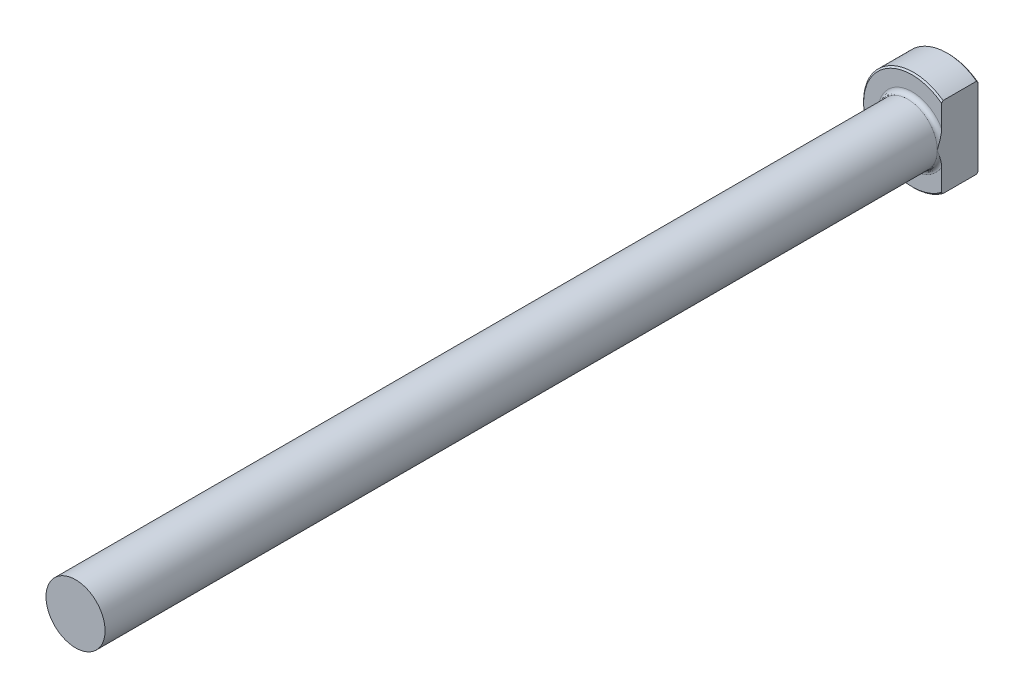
ISO-10303-21;
HEADER;
FILE_DESCRIPTION(('STEP AP214'),'2;1');
FILE_NAME('part.step','',(''),(''),'','','');
FILE_SCHEMA(('AUTOMOTIVE_DESIGN { 1 0 10303 214 1 1 1 1 }'));
ENDSEC;
DATA;
#1=APPLICATION_CONTEXT('core data for automotive mechanical design processes');
#2=APPLICATION_PROTOCOL_DEFINITION('international standard','automotive_design',2000,#1);
#3=PRODUCT_CONTEXT('',#1,'mechanical');
#4=PRODUCT('Part','Part','',(#3));
#5=PRODUCT_RELATED_PRODUCT_CATEGORY('part','',(#4));
#6=PRODUCT_DEFINITION_FORMATION('','',#4);
#7=PRODUCT_DEFINITION_CONTEXT('part definition',#1,'design');
#8=PRODUCT_DEFINITION('design','',#6,#7);
#9=PRODUCT_DEFINITION_SHAPE('','',#8);
#10=(LENGTH_UNIT() NAMED_UNIT(*) SI_UNIT(.MILLI.,.METRE.));
#11=(NAMED_UNIT(*) PLANE_ANGLE_UNIT() SI_UNIT($,.RADIAN.));
#12=(NAMED_UNIT(*) SI_UNIT($,.STERADIAN.) SOLID_ANGLE_UNIT());
#13=UNCERTAINTY_MEASURE_WITH_UNIT(LENGTH_MEASURE(1.E-05),#10,'distance_accuracy_value','');
#14=(GEOMETRIC_REPRESENTATION_CONTEXT(3) GLOBAL_UNCERTAINTY_ASSIGNED_CONTEXT((#13)) GLOBAL_UNIT_ASSIGNED_CONTEXT((#10,
#11,#12)) REPRESENTATION_CONTEXT('',''));
#15=CARTESIAN_POINT('',(0.,0.,0.));
#16=DIRECTION('',(0.,0.,1.));
#17=DIRECTION('',(1.,0.,0.));
#18=AXIS2_PLACEMENT_3D('',#15,#16,#17);
#19=CARTESIAN_POINT('',(0.,5.15873999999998,152.4));
#20=DIRECTION('',(0.,0.,1.));
#21=DIRECTION('',(1.,0.,0.));
#22=AXIS2_PLACEMENT_3D('',#19,#20,#21);
#23=PLANE('',#22);
#24=CARTESIAN_POINT('',(0.,0.,152.4));
#25=DIRECTION('',(0.,0.,-1.));
#26=DIRECTION('',(-1.,0.,0.));
#27=AXIS2_PLACEMENT_3D('',#24,#25,#26);
#28=CIRCLE('',#27,5.15873999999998);
#29=CARTESIAN_POINT('',(-5.15873999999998,0.,152.4));
#30=VERTEX_POINT('',#29);
#31=EDGE_CURVE('E96',#30,#30,#28,.T.);
#32=ORIENTED_EDGE('',*,*,#31,.F.);
#33=EDGE_LOOP('',(#32));
#34=FACE_BOUND('',#33,.T.);
#35=ADVANCED_FACE('F32',(#34),#23,.T.);
#36=CARTESIAN_POINT('',(0.,0.,-25.4347445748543));
#37=DIRECTION('',(0.,0.,-1.));
#38=DIRECTION('',(-1.,0.,0.));
#39=AXIS2_PLACEMENT_3D('',#36,#37,#38);
#40=CYLINDRICAL_SURFACE('',#39,5.15873999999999);
#41=ORIENTED_EDGE('',*,*,#31,.T.);
#42=EDGE_LOOP('',(#41));
#43=FACE_BOUND('',#42,.T.);
#44=CARTESIAN_POINT('',(0.,0.,7.112));
#45=DIRECTION('',(0.,0.,-1.));
#46=DIRECTION('',(-1.,0.,0.));
#47=AXIS2_PLACEMENT_3D('',#44,#45,#46);
#48=CIRCLE('',#47,5.15873999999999);
#49=CARTESIAN_POINT('',(5.15873999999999,0.,7.112));
#50=VERTEX_POINT('',#49);
#51=EDGE_CURVE('E101',#50,#50,#48,.T.);
#52=ORIENTED_EDGE('',*,*,#51,.F.);
#53=EDGE_LOOP('',(#52));
#54=FACE_BOUND('',#53,.T.);
#55=ADVANCED_FACE('F158',(#43,#54),#40,.T.);
#56=CARTESIAN_POINT('',(0.,0.,7.112));
#57=DIRECTION('',(0.,0.,-1.));
#58=DIRECTION('',(-1.,0.,0.));
#59=AXIS2_PLACEMENT_3D('',#56,#57,#58);
#60=TOROIDAL_SURFACE('',#59,5.92074,0.762);
#61=CARTESIAN_POINT('',(5.15873999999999,0.,7.112));
#62=CARTESIAN_POINT('',(5.15873999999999,-5.71096526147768E-11,7.11200099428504));
#63=CARTESIAN_POINT('',(5.15873999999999,-2.22462273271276E-07,7.11200198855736));
#64=CARTESIAN_POINT('',(5.15873999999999,-9.18675676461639E-07,7.11200389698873));
#65=CARTESIAN_POINT('',(5.15873999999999,-1.40015166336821E-06,7.11200480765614));
#66=CARTESIAN_POINT('',(5.15873999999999,-2.5548942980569E-06,7.11200662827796));
#67=CARTESIAN_POINT('',(5.15873999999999,-3.24258702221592E-06,7.11200752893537));
#68=CARTESIAN_POINT('',(5.15873999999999,-4.72017169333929E-06,7.11200922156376));
#69=CARTESIAN_POINT('',(5.15873999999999,-5.50898685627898E-06,7.11201001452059));
#70=CARTESIAN_POINT('',(5.15873999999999,-8.35669321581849E-06,7.11201269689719));
#71=CARTESIAN_POINT('',(5.15873999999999,-1.05473927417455E-05,7.11201444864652));
#72=CARTESIAN_POINT('',(5.15873999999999,-1.50564248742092E-05,7.11201754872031));
#73=CARTESIAN_POINT('',(5.15873999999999,-1.73660536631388E-05,7.11201891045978));
#74=CARTESIAN_POINT('',(5.15873999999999,-2.64531968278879E-05,7.11202408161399));
#75=CARTESIAN_POINT('',(5.15873999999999,-3.33874300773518E-05,7.11202762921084));
#76=CARTESIAN_POINT('',(5.15873999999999,-4.70045811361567E-05,7.11203337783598));
#77=CARTESIAN_POINT('',(5.15873999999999,-5.36479360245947E-05,7.11203567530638));
#78=CARTESIAN_POINT('',(5.15873999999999,-8.21517361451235E-05,7.11204552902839));
#79=CARTESIAN_POINT('',(5.15873999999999,-0.000104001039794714,7.11205307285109));
#80=CARTESIAN_POINT('',(5.15873999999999,-0.000144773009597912,7.11206508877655));
#81=CARTESIAN_POINT('',(5.15873999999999,-0.000163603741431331,7.11206985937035));
#82=CARTESIAN_POINT('',(5.15873999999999,-0.000301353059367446,7.11210789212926));
#83=CARTESIAN_POINT('',(5.15873999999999,-0.000415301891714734,7.11215671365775));
#84=CARTESIAN_POINT('',(5.15874,-0.000859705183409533,7.11234018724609));
#85=CARTESIAN_POINT('',(5.15873999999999,-0.00119360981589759,7.11246325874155));
#86=CARTESIAN_POINT('',(5.15873999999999,-0.00249469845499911,7.11294988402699));
#87=CARTESIAN_POINT('',(5.15873999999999,-0.00345835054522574,7.11332557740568));
#88=CARTESIAN_POINT('',(5.15874,-0.00741501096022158,7.11486093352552));
#89=CARTESIAN_POINT('',(5.15874,-0.0104118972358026,7.11600695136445));
#90=CARTESIAN_POINT('',(5.15873999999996,-0.0786450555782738,7.1421088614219));
#91=CARTESIAN_POINT('',(5.15873999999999,-0.143832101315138,7.16724024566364));
#92=CARTESIAN_POINT('',(5.15874,-0.271846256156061,7.21626493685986));
#93=CARTESIAN_POINT('',(5.15874,-0.334669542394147,7.24016916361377));
#94=CARTESIAN_POINT('',(5.15873999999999,-0.467921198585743,7.29047824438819));
#95=CARTESIAN_POINT('',(5.15873999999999,-0.538365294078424,7.31684232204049));
#96=CARTESIAN_POINT('',(5.15873999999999,-0.680238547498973,7.36916045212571));
#97=CARTESIAN_POINT('',(5.15873999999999,-0.75167033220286,7.39510739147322));
#98=CARTESIAN_POINT('',(5.15873999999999,-0.875787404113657,7.43926910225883));
#99=CARTESIAN_POINT('',(5.15873999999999,-0.928395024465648,7.45770157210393));
#100=CARTESIAN_POINT('',(5.15873999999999,-1.03369210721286,7.49390539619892));
#101=CARTESIAN_POINT('',(5.15873999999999,-1.08638104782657,7.51167826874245));
#102=CARTESIAN_POINT('',(5.15873999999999,-1.24240335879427,7.56311853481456));
#103=CARTESIAN_POINT('',(5.15873999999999,-1.34607677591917,7.59576609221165));
#104=CARTESIAN_POINT('',(5.15873999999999,-1.56903478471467,7.66167227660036));
#105=CARTESIAN_POINT('',(5.15873999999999,-1.68848368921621,7.69438341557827));
#106=CARTESIAN_POINT('',(5.15873999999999,-1.92989031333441,7.75365964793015));
#107=CARTESIAN_POINT('',(5.15873999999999,-2.05186020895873,7.78017606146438));
#108=CARTESIAN_POINT('',(5.15873999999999,-2.30542764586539,7.82616956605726));
#109=CARTESIAN_POINT('',(5.15873999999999,-2.43713336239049,7.84507322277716));
#110=CARTESIAN_POINT('',(5.15873999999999,-2.70142266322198,7.86997524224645));
#111=CARTESIAN_POINT('',(5.15873999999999,-2.83400172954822,7.87601734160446));
#112=CARTESIAN_POINT('',(5.15873999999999,-3.07786708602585,7.87120841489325));
#113=CARTESIAN_POINT('',(5.15873999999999,-3.18916926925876,7.86290343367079));
#114=CARTESIAN_POINT('',(5.15873999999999,-3.35356811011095,7.83843538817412));
#115=CARTESIAN_POINT('',(5.15873999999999,-3.40757724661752,7.82838746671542));
#116=CARTESIAN_POINT('',(5.15873999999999,-3.51452169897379,7.80372264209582));
#117=CARTESIAN_POINT('',(5.15873999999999,-3.56745790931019,7.78910972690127));
#118=CARTESIAN_POINT('',(5.15873999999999,-3.67141391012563,7.75462249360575));
#119=CARTESIAN_POINT('',(5.15873999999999,-3.72243976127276,7.73476677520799));
#120=CARTESIAN_POINT('',(5.15873999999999,-3.82180221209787,7.68881416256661));
#121=CARTESIAN_POINT('',(5.15873999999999,-3.87013355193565,7.66270555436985));
#122=CARTESIAN_POINT('',(5.15873999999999,-3.95437955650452,7.60833814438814));
#123=CARTESIAN_POINT('',(5.15873999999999,-3.99100842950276,7.58119900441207));
#124=CARTESIAN_POINT('',(5.15873999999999,-4.05950827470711,7.521465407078));
#125=CARTESIAN_POINT('',(5.15873999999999,-4.09139060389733,7.48888438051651));
#126=CARTESIAN_POINT('',(5.15873999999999,-4.14001626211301,7.42835858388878));
#127=CARTESIAN_POINT('',(5.15873999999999,-4.15847181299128,7.40179558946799));
#128=CARTESIAN_POINT('',(5.15873999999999,-4.19090911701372,7.34603838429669));
#129=CARTESIAN_POINT('',(5.15873999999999,-4.20489341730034,7.31684568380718));
#130=CARTESIAN_POINT('',(5.15873999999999,-4.2274857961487,7.25610717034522));
#131=CARTESIAN_POINT('',(5.15873999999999,-4.23604352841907,7.22454227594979));
#132=CARTESIAN_POINT('',(5.15873999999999,-4.24676787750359,7.16034510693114));
#133=CARTESIAN_POINT('',(5.15873999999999,-4.24894017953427,7.12771380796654));
#134=CARTESIAN_POINT('',(5.15873999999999,-4.24684450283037,7.06710688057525));
#135=CARTESIAN_POINT('',(5.15873999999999,-4.24340836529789,7.03909886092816));
#136=CARTESIAN_POINT('',(5.15873999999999,-4.23188213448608,6.98406469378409));
#137=CARTESIAN_POINT('',(5.15873999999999,-4.22379138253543,6.95703868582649));
#138=CARTESIAN_POINT('',(5.15873999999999,-4.20347109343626,6.90452092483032));
#139=CARTESIAN_POINT('',(5.15873999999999,-4.19122933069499,6.87903396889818));
#140=CARTESIAN_POINT('',(5.15873999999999,-4.16329026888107,6.8300511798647));
#141=CARTESIAN_POINT('',(5.15873999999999,-4.14759175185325,6.80655605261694));
#142=CARTESIAN_POINT('',(5.15873999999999,-4.10376088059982,6.74908369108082));
#143=CARTESIAN_POINT('',(5.15873999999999,-4.07360310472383,6.71664886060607));
#144=CARTESIAN_POINT('',(5.15873999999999,-4.00851995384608,6.65694433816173));
#145=CARTESIAN_POINT('',(5.15873999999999,-3.97358021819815,6.62969081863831));
#146=CARTESIAN_POINT('',(5.15873999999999,-3.8805300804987,6.56638632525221));
#147=CARTESIAN_POINT('',(5.15873999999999,-3.82017911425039,6.53364898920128));
#148=CARTESIAN_POINT('',(5.15873999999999,-3.69543812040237,6.4777365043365));
#149=CARTESIAN_POINT('',(5.15873999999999,-3.63104984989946,6.45455722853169));
#150=CARTESIAN_POINT('',(5.15873999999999,-3.50887482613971,6.41860687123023));
#151=CARTESIAN_POINT('',(5.15873999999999,-3.45136825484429,6.40485393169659));
#152=CARTESIAN_POINT('',(5.15873999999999,-3.33536327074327,6.38231170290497));
#153=CARTESIAN_POINT('',(5.15873999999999,-3.27686406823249,6.37352657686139));
#154=CARTESIAN_POINT('',(5.15873999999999,-3.15852059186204,6.36012170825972));
#155=CARTESIAN_POINT('',(5.15873999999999,-3.0986692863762,6.35556622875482));
#156=CARTESIAN_POINT('',(5.15873999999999,-2.97884734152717,6.35024260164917));
#157=CARTESIAN_POINT('',(5.15873999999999,-2.91887679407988,6.34947220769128));
#158=CARTESIAN_POINT('',(5.15873999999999,-2.78216532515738,6.35145172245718));
#159=CARTESIAN_POINT('',(5.15873999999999,-2.70544052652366,6.35525009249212));
#160=CARTESIAN_POINT('',(5.15873999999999,-2.55233801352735,6.36736248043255));
#161=CARTESIAN_POINT('',(5.15873999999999,-2.47596045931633,6.37567840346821));
#162=CARTESIAN_POINT('',(5.15873999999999,-2.24707932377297,6.40639527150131));
#163=CARTESIAN_POINT('',(5.15873999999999,-2.09534495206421,6.4345478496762));
#164=CARTESIAN_POINT('',(5.15873999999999,-1.80513264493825,6.49936431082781));
#165=CARTESIAN_POINT('',(5.15873999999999,-1.66647835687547,6.53528203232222));
#166=CARTESIAN_POINT('',(5.15873999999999,-1.39234806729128,6.61358484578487));
#167=CARTESIAN_POINT('',(5.15873999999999,-1.25685484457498,6.65591034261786));
#168=CARTESIAN_POINT('',(5.15873999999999,-1.04264776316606,6.72688435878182));
#169=CARTESIAN_POINT('',(5.15873999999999,-0.963424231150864,6.75402805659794));
#170=CARTESIAN_POINT('',(5.15873999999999,-0.843959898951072,6.7960100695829));
#171=CARTESIAN_POINT('',(5.15873999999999,-0.803558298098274,6.81039072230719));
#172=CARTESIAN_POINT('',(5.15873999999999,-0.722756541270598,6.83946542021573));
#173=CARTESIAN_POINT('',(5.15873999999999,-0.682356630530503,6.85416014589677));
#174=CARTESIAN_POINT('',(5.15873999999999,-0.586562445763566,6.88931497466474));
#175=CARTESIAN_POINT('',(5.15873999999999,-0.531205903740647,6.90987772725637));
#176=CARTESIAN_POINT('',(5.15873999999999,-0.421180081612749,6.95111947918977));
#177=CARTESIAN_POINT('',(5.15873999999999,-0.366509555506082,6.97179514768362));
#178=CARTESIAN_POINT('',(5.15874,-0.263037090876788,7.01112584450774));
#179=CARTESIAN_POINT('',(5.15874,-0.214227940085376,7.02976250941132));
#180=CARTESIAN_POINT('',(5.15873999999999,-0.114760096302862,7.06792284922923));
#181=CARTESIAN_POINT('',(5.15873999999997,-0.064103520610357,7.08745276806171));
#182=CARTESIAN_POINT('',(5.15874,-0.0104130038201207,7.10799268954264));
#183=CARTESIAN_POINT('',(5.15874,-0.00741719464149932,7.10913824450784));
#184=CARTESIAN_POINT('',(5.15873999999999,-0.00346079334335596,7.1106734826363));
#185=CARTESIAN_POINT('',(5.15873999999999,-0.00249631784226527,7.1110494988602));
#186=CARTESIAN_POINT('',(5.15873999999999,-0.00119418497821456,7.11153651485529));
#187=CARTESIAN_POINT('',(5.15874,-0.000860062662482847,7.11165966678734));
#188=CARTESIAN_POINT('',(5.15873999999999,-0.000415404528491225,7.11184324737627));
#189=CARTESIAN_POINT('',(5.15873999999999,-0.000301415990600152,7.1118920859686));
#190=CARTESIAN_POINT('',(5.15873999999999,-0.000163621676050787,7.11193012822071));
#191=CARTESIAN_POINT('',(5.15873999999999,-0.000144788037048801,7.11193489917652));
#192=CARTESIAN_POINT('',(5.15873999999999,-0.000104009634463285,7.11194691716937));
#193=CARTESIAN_POINT('',(5.15873999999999,-8.21568836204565E-05,7.11195446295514));
#194=CARTESIAN_POINT('',(5.15873999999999,-5.36492183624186E-05,7.11196431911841));
#195=CARTESIAN_POINT('',(5.15873999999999,-4.70054182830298E-05,7.11196661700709));
#196=CARTESIAN_POINT('',(5.15873999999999,-3.33874222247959E-05,7.11197236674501));
#197=CARTESIAN_POINT('',(5.15873999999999,-2.64528061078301E-05,7.11197591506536));
#198=CARTESIAN_POINT('',(5.15873999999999,-1.73652992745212E-05,7.11198108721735));
#199=CARTESIAN_POINT('',(5.15873999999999,-1.50556358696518E-05,7.11198244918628));
#200=CARTESIAN_POINT('',(5.15873999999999,-1.05465795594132E-05,7.11198554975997));
#201=CARTESIAN_POINT('',(5.15873999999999,-8.35589300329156E-06,7.11198730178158));
#202=CARTESIAN_POINT('',(5.15873999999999,-5.50825820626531E-06,7.11198998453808));
#203=CARTESIAN_POINT('',(5.15873999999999,-4.71947444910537E-06,7.11199077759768));
#204=CARTESIAN_POINT('',(5.15873999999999,-3.24197103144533E-06,7.11199247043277));
#205=CARTESIAN_POINT('',(5.15873999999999,-2.55432839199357E-06,7.11199337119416));
#206=CARTESIAN_POINT('',(5.15873999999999,-1.39970671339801E-06,7.11199519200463));
#207=CARTESIAN_POINT('',(5.15873999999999,-9.18298919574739E-07,7.11199610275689));
#208=CARTESIAN_POINT('',(5.15873999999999,-2.22251559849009E-07,7.11199801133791));
#209=CARTESIAN_POINT('',(5.15873999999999,5.71119294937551E-11,7.11199900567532));
#210=CARTESIAN_POINT('',(5.15873999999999,0.,7.112));
#211=B_SPLINE_CURVE_WITH_KNOTS('',3,(#61,#62,#63,#64,#65,#66,#67,#68,#69,#70,#71,#72,#73,#74,
#75,#76,#77,#78,#79,#80,#81,#82,#83,#84,#85,#86,#87,#88,#89,#90,#91,#92,#93,#94,#95,#96,#97,#98,
#99,#100,#101,#102,#103,#104,#105,#106,#107,#108,#109,#110,#111,#112,#113,#114,#115,#116,#117,
#118,#119,#120,#121,#122,#123,#124,#125,#126,#127,#128,#129,#130,#131,#132,#133,#134,#135,#136,
#137,#138,#139,#140,#141,#142,#143,#144,#145,#146,#147,#148,#149,#150,#151,#152,#153,#154,#155,
#156,#157,#158,#159,#160,#161,#162,#163,#164,#165,#166,#167,#168,#169,#170,#171,#172,#173,#174,
#175,#176,#177,#178,#179,#180,#181,#182,#183,#184,#185,#186,#187,#188,#189,#190,#191,#192,#193,
#194,#195,#196,#197,#198,#199,#200,#201,#202,#203,#204,#205,#206,#207,#208,#209,#210),
.UNSPECIFIED.,.T.,.F.,(4,2,2,2,2,2,2,2,2,2,2,2,2,2,2,2,2,2,2,2,2,2,2,2,2,2,2,2,2,2,2,2,2,2,2,2,
2,2,2,2,2,2,2,2,2,2,2,2,2,2,2,2,2,2,2,2,2,2,2,2,2,2,2,2,2,2,2,2,2,2,2,2,2,2,4),(0.,
2.98208730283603E-06,6.05772389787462E-06,9.44292012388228E-06,1.27946727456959E-05,
2.11693770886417E-05,2.920651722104E-05,5.25039644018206E-05,7.35695368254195E-05,
0.000142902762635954,0.000201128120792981,0.000571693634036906,0.00164038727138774,
0.00474189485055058,0.0143689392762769,0.223938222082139,0.425595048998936,0.651239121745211,
0.879229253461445,1.04645574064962,1.2132698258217,1.53929704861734,1.91070529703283,
2.28494074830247,2.68363864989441,3.08097857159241,3.41480193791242,3.57945258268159,
3.74395978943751,3.90789104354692,4.07213183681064,4.20845780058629,4.34445214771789,
4.44113978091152,4.53777223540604,4.63528858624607,4.73271808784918,4.81696142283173,
4.90121668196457,4.98572227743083,5.07025769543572,5.20236857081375,5.33488526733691,
5.53970762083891,5.74444144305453,5.92157591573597,6.09885861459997,6.27879277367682,
6.45862013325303,6.68890733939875,6.91929173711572,7.38160659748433,7.81109925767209,
8.2368183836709,8.48804397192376,8.61669661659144,8.74566393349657,8.92281963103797,
9.09816642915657,9.2549087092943,9.41776479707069,9.42738834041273,9.4304924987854,
9.43156188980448,9.43193258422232,9.43199081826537,9.43206016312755,9.43208123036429,
9.43210452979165,9.43211256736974,9.43212094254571,9.43212429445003,9.43212767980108,
9.43213075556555,9.43213373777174),.UNSPECIFIED.);
#212=CARTESIAN_POINT('',(5.15873999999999,-2.90560901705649,6.35));
#213=VERTEX_POINT('',#212);
#214=EDGE_CURVE('E142',#213,#50,#211,.T.);
#215=ORIENTED_EDGE('',*,*,#214,.T.);
#216=ORIENTED_EDGE('',*,*,#51,.T.);
#217=CARTESIAN_POINT('',(5.15873999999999,0.,7.112));
#218=CARTESIAN_POINT('',(5.15873999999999,5.71096793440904E-11,7.11199900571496));
#219=CARTESIAN_POINT('',(5.15873999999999,2.22462273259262E-07,7.11199801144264));
#220=CARTESIAN_POINT('',(5.15873999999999,9.18675676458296E-07,7.11199610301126));
#221=CARTESIAN_POINT('',(5.15873999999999,1.40015166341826E-06,7.11199519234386));
#222=CARTESIAN_POINT('',(5.15873999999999,2.55489429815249E-06,7.11199337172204));
#223=CARTESIAN_POINT('',(5.15873999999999,3.24258702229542E-06,7.11199247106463));
#224=CARTESIAN_POINT('',(5.15873999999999,4.72017169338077E-06,7.11199077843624));
#225=CARTESIAN_POINT('',(5.15873999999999,5.50898685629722E-06,7.11198998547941));
#226=CARTESIAN_POINT('',(5.15873999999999,8.3566932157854E-06,7.11198730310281));
#227=CARTESIAN_POINT('',(5.15873999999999,1.05473927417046E-05,7.11198555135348));
#228=CARTESIAN_POINT('',(5.15873999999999,1.50564248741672E-05,7.11198245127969));
#229=CARTESIAN_POINT('',(5.15873999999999,1.73660536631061E-05,7.11198108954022));
#230=CARTESIAN_POINT('',(5.15873999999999,2.64531968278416E-05,7.11197591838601));
#231=CARTESIAN_POINT('',(5.15873999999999,3.33874300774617E-05,7.11197237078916));
#232=CARTESIAN_POINT('',(5.15873999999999,4.70045811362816E-05,7.11196662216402));
#233=CARTESIAN_POINT('',(5.15873999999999,5.36479360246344E-05,7.11196432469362));
#234=CARTESIAN_POINT('',(5.15873999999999,8.21517361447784E-05,7.1119544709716));
#235=CARTESIAN_POINT('',(5.15873999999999,0.000104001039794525,7.11194692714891));
#236=CARTESIAN_POINT('',(5.15873999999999,0.000144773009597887,7.11193491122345));
#237=CARTESIAN_POINT('',(5.15873999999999,0.000163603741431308,7.11193014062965));
#238=CARTESIAN_POINT('',(5.15873999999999,0.000301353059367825,7.11189210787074));
#239=CARTESIAN_POINT('',(5.15873999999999,0.000415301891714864,7.11184328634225));
#240=CARTESIAN_POINT('',(5.15874,0.000859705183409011,7.11165981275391));
#241=CARTESIAN_POINT('',(5.15873999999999,0.00119360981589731,7.11153674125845));
#242=CARTESIAN_POINT('',(5.15873999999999,0.00249469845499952,7.11105011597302));
#243=CARTESIAN_POINT('',(5.15873999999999,0.00345835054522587,7.11067442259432));
#244=CARTESIAN_POINT('',(5.15874,0.00741501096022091,7.10913906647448));
#245=CARTESIAN_POINT('',(5.15874,0.0104118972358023,7.10799304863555));
#246=CARTESIAN_POINT('',(5.15873999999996,0.0786450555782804,7.08189113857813));
#247=CARTESIAN_POINT('',(5.15873999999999,0.143832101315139,7.05675975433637));
#248=CARTESIAN_POINT('',(5.15874,0.271846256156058,7.00773506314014));
#249=CARTESIAN_POINT('',(5.15874,0.334669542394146,6.98383083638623));
#250=CARTESIAN_POINT('',(5.15873999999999,0.467921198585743,6.93352175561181));
#251=CARTESIAN_POINT('',(5.15873999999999,0.538365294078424,6.90715767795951));
#252=CARTESIAN_POINT('',(5.15873999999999,0.680238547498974,6.85483954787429));
#253=CARTESIAN_POINT('',(5.15873999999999,0.751670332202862,6.82889260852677));
#254=CARTESIAN_POINT('',(5.15873999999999,0.875787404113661,6.78473089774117));
#255=CARTESIAN_POINT('',(5.15873999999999,0.928395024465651,6.76629842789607));
#256=CARTESIAN_POINT('',(5.15873999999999,1.03369210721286,6.73009460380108));
#257=CARTESIAN_POINT('',(5.15873999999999,1.08638104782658,6.71232173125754));
#258=CARTESIAN_POINT('',(5.15873999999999,1.24240335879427,6.66088146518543));
#259=CARTESIAN_POINT('',(5.15873999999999,1.34607677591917,6.62823390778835));
#260=CARTESIAN_POINT('',(5.15873999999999,1.56903478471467,6.56232772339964));
#261=CARTESIAN_POINT('',(5.15873999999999,1.68848368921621,6.52961658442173));
#262=CARTESIAN_POINT('',(5.15873999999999,1.92989031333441,6.47034035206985));
#263=CARTESIAN_POINT('',(5.15873999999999,2.05186020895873,6.44382393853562));
#264=CARTESIAN_POINT('',(5.15873999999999,2.30542764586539,6.39783043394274));
#265=CARTESIAN_POINT('',(5.15873999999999,2.43713336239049,6.37892677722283));
#266=CARTESIAN_POINT('',(5.15873999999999,2.70142266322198,6.35402475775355));
#267=CARTESIAN_POINT('',(5.15873999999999,2.83400172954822,6.34798265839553));
#268=CARTESIAN_POINT('',(5.15873999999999,3.07786708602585,6.35279158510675));
#269=CARTESIAN_POINT('',(5.15873999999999,3.18916926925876,6.36109656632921));
#270=CARTESIAN_POINT('',(5.15873999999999,3.35356811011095,6.38556461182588));
#271=CARTESIAN_POINT('',(5.15873999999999,3.40757724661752,6.39561253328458));
#272=CARTESIAN_POINT('',(5.15873999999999,3.51452169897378,6.42027735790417));
#273=CARTESIAN_POINT('',(5.15873999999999,3.56745790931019,6.43489027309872));
#274=CARTESIAN_POINT('',(5.15873999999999,3.67141391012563,6.46937750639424));
#275=CARTESIAN_POINT('',(5.15873999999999,3.72243976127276,6.48923322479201));
#276=CARTESIAN_POINT('',(5.15873999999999,3.82180221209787,6.53518583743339));
#277=CARTESIAN_POINT('',(5.15873999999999,3.87013355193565,6.56129444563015));
#278=CARTESIAN_POINT('',(5.15873999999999,3.95437955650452,6.61566185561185));
#279=CARTESIAN_POINT('',(5.15873999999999,3.99100842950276,6.64280099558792));
#280=CARTESIAN_POINT('',(5.15873999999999,4.05950827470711,6.702534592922));
#281=CARTESIAN_POINT('',(5.15873999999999,4.09139060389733,6.73511561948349));
#282=CARTESIAN_POINT('',(5.15873999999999,4.14001626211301,6.79564141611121));
#283=CARTESIAN_POINT('',(5.15873999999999,4.15847181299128,6.82220441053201));
#284=CARTESIAN_POINT('',(5.15873999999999,4.19090911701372,6.87796161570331));
#285=CARTESIAN_POINT('',(5.15873999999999,4.20489341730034,6.90715431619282));
#286=CARTESIAN_POINT('',(5.15873999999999,4.2274857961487,6.96789282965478));
#287=CARTESIAN_POINT('',(5.15873999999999,4.23604352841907,6.9994577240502));
#288=CARTESIAN_POINT('',(5.15873999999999,4.24676787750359,7.06365489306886));
#289=CARTESIAN_POINT('',(5.15873999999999,4.24894017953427,7.09628619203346));
#290=CARTESIAN_POINT('',(5.15873999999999,4.24684450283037,7.15689311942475));
#291=CARTESIAN_POINT('',(5.15873999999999,4.2434083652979,7.18490113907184));
#292=CARTESIAN_POINT('',(5.15873999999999,4.23188213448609,7.23993530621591));
#293=CARTESIAN_POINT('',(5.15873999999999,4.22379138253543,7.26696131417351));
#294=CARTESIAN_POINT('',(5.15873999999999,4.20347109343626,7.31947907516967));
#295=CARTESIAN_POINT('',(5.15873999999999,4.19122933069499,7.34496603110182));
#296=CARTESIAN_POINT('',(5.15873999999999,4.16329026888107,7.3939488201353));
#297=CARTESIAN_POINT('',(5.15873999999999,4.14759175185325,7.41744394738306));
#298=CARTESIAN_POINT('',(5.15873999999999,4.10376088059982,7.47491630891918));
#299=CARTESIAN_POINT('',(5.15873999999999,4.07360310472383,7.50735113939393));
#300=CARTESIAN_POINT('',(5.15873999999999,4.00851995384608,7.56705566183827));
#301=CARTESIAN_POINT('',(5.15873999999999,3.97358021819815,7.59430918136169));
#302=CARTESIAN_POINT('',(5.15873999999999,3.8805300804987,7.65761367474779));
#303=CARTESIAN_POINT('',(5.15873999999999,3.82017911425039,7.69035101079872));
#304=CARTESIAN_POINT('',(5.15873999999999,3.69543812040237,7.7462634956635));
#305=CARTESIAN_POINT('',(5.15873999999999,3.63104984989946,7.76944277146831));
#306=CARTESIAN_POINT('',(5.15873999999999,3.50887482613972,7.80539312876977));
#307=CARTESIAN_POINT('',(5.15873999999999,3.45136825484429,7.81914606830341));
#308=CARTESIAN_POINT('',(5.15873999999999,3.33536327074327,7.84168829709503));
#309=CARTESIAN_POINT('',(5.15873999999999,3.27686406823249,7.85047342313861));
#310=CARTESIAN_POINT('',(5.15873999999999,3.15852059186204,7.86387829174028));
#311=CARTESIAN_POINT('',(5.15873999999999,3.0986692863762,7.86843377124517));
#312=CARTESIAN_POINT('',(5.15873999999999,2.97884734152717,7.87375739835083));
#313=CARTESIAN_POINT('',(5.15873999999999,2.91887679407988,7.87452779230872));
#314=CARTESIAN_POINT('',(5.15873999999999,2.78216532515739,7.87254827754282));
#315=CARTESIAN_POINT('',(5.15873999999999,2.70544052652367,7.86874990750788));
#316=CARTESIAN_POINT('',(5.15873999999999,2.55233801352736,7.85663751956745));
#317=CARTESIAN_POINT('',(5.15873999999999,2.47596045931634,7.84832159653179));
#318=CARTESIAN_POINT('',(5.15873999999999,2.24707932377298,7.81760472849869));
#319=CARTESIAN_POINT('',(5.15873999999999,2.09534495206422,7.7894521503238));
#320=CARTESIAN_POINT('',(5.15873999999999,1.80513264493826,7.7246356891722));
#321=CARTESIAN_POINT('',(5.15873999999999,1.66647835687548,7.68871796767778));
#322=CARTESIAN_POINT('',(5.15873999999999,1.39234806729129,7.61041515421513));
#323=CARTESIAN_POINT('',(5.15873999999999,1.256854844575,7.56808965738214));
#324=CARTESIAN_POINT('',(5.15873999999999,1.04264776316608,7.49711564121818));
#325=CARTESIAN_POINT('',(5.15873999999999,0.963424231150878,7.46997194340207));
#326=CARTESIAN_POINT('',(5.15873999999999,0.843959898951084,7.42798993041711));
#327=CARTESIAN_POINT('',(5.15873999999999,0.803558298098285,7.41360927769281));
#328=CARTESIAN_POINT('',(5.15873999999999,0.722756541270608,7.38453457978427));
#329=CARTESIAN_POINT('',(5.15873999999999,0.682356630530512,7.36983985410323));
#330=CARTESIAN_POINT('',(5.15873999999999,0.586562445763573,7.33468502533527));
#331=CARTESIAN_POINT('',(5.15873999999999,0.531205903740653,7.31412227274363));
#332=CARTESIAN_POINT('',(5.15873999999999,0.421180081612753,7.27288052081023));
#333=CARTESIAN_POINT('',(5.15873999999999,0.366509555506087,7.25220485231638));
#334=CARTESIAN_POINT('',(5.15874,0.263037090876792,7.21287415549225));
#335=CARTESIAN_POINT('',(5.15874,0.214227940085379,7.19423749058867));
#336=CARTESIAN_POINT('',(5.15873999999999,0.114760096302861,7.15607715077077));
#337=CARTESIAN_POINT('',(5.15873999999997,0.0641035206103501,7.13654723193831));
#338=CARTESIAN_POINT('',(5.15874,0.0104130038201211,7.11600731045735));
#339=CARTESIAN_POINT('',(5.15874,0.00741719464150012,7.11486175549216));
#340=CARTESIAN_POINT('',(5.15873999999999,0.00346079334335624,7.11332651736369));
#341=CARTESIAN_POINT('',(5.15873999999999,0.00249631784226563,7.1129505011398));
#342=CARTESIAN_POINT('',(5.15873999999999,0.00119418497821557,7.11246348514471));
#343=CARTESIAN_POINT('',(5.15874,0.000860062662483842,7.11234033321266));
#344=CARTESIAN_POINT('',(5.15873999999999,0.000415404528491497,7.11215675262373));
#345=CARTESIAN_POINT('',(5.15873999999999,0.000301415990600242,7.1121079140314));
#346=CARTESIAN_POINT('',(5.15873999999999,0.00016362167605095,7.11206987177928));
#347=CARTESIAN_POINT('',(5.15873999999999,0.000144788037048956,7.11206510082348));
#348=CARTESIAN_POINT('',(5.15873999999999,0.000104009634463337,7.11205308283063));
#349=CARTESIAN_POINT('',(5.15873999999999,8.21568836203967E-05,7.11204553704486));
#350=CARTESIAN_POINT('',(5.15873999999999,5.36492183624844E-05,7.11203568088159));
#351=CARTESIAN_POINT('',(5.15873999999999,4.70054182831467E-05,7.11203338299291));
#352=CARTESIAN_POINT('',(5.15873999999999,3.33874222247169E-05,7.11202763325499));
#353=CARTESIAN_POINT('',(5.15873999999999,2.64528061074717E-05,7.11202408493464));
#354=CARTESIAN_POINT('',(5.15873999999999,1.73652992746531E-05,7.11201891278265));
#355=CARTESIAN_POINT('',(5.15873999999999,1.50556358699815E-05,7.11201755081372));
#356=CARTESIAN_POINT('',(5.15873999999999,1.05465795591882E-05,7.11201445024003));
#357=CARTESIAN_POINT('',(5.15873999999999,8.35589300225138E-06,7.11201269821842));
#358=CARTESIAN_POINT('',(5.15873999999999,5.50825820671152E-06,7.11201001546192));
#359=CARTESIAN_POINT('',(5.15873999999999,4.71947445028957E-06,7.11200922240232));
#360=CARTESIAN_POINT('',(5.15873999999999,3.2419710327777E-06,7.11200752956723));
#361=CARTESIAN_POINT('',(5.15873999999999,2.55432839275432E-06,7.11200662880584));
#362=CARTESIAN_POINT('',(5.15873999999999,1.39970671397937E-06,7.11200480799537));
#363=CARTESIAN_POINT('',(5.15873999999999,9.18298920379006E-07,7.11200389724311));
#364=CARTESIAN_POINT('',(5.15873999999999,2.22251560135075E-07,7.11200198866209));
#365=CARTESIAN_POINT('',(5.15873999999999,-5.7111956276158E-11,7.11200099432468));
#366=CARTESIAN_POINT('',(5.15873999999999,0.,7.112));
#367=B_SPLINE_CURVE_WITH_KNOTS('',3,(#217,#218,#219,#220,#221,#222,#223,#224,#225,#226,#227,
#228,#229,#230,#231,#232,#233,#234,#235,#236,#237,#238,#239,#240,#241,#242,#243,#244,#245,#246,
#247,#248,#249,#250,#251,#252,#253,#254,#255,#256,#257,#258,#259,#260,#261,#262,#263,#264,#265,
#266,#267,#268,#269,#270,#271,#272,#273,#274,#275,#276,#277,#278,#279,#280,#281,#282,#283,#284,
#285,#286,#287,#288,#289,#290,#291,#292,#293,#294,#295,#296,#297,#298,#299,#300,#301,#302,#303,
#304,#305,#306,#307,#308,#309,#310,#311,#312,#313,#314,#315,#316,#317,#318,#319,#320,#321,#322,
#323,#324,#325,#326,#327,#328,#329,#330,#331,#332,#333,#334,#335,#336,#337,#338,#339,#340,#341,
#342,#343,#344,#345,#346,#347,#348,#349,#350,#351,#352,#353,#354,#355,#356,#357,#358,#359,#360,
#361,#362,#363,#364,#365,#366),.UNSPECIFIED.,.T.,.F.,(4,2,2,2,2,2,2,2,2,2,2,2,2,2,2,2,2,2,2,2,2,
2,2,2,2,2,2,2,2,2,2,2,2,2,2,2,2,2,2,2,2,2,2,2,2,2,2,2,2,2,2,2,2,2,2,2,2,2,2,2,2,2,2,2,2,2,2,2,2,
2,2,2,2,2,4),(0.,2.98208730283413E-06,6.05772389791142E-06,9.44292012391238E-06,
1.27946727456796E-05,2.11693770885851E-05,2.92065172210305E-05,5.25039644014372E-05,
7.35695368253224E-05,0.000142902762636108,0.000201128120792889,0.000571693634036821,
0.00164038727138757,0.00474189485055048,0.0143689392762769,0.223938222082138,0.425595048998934,
0.651239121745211,0.879229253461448,1.04645574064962,1.2132698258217,1.53929704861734,
1.91070529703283,2.28494074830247,2.68363864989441,3.08097857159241,3.41480193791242,
3.57945258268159,3.7439597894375,3.90789104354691,4.07213183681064,4.20845780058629,
4.34445214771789,4.44113978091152,4.53777223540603,4.63528858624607,4.73271808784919,
4.81696142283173,4.90121668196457,4.98572227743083,5.07025769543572,5.20236857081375,
5.33488526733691,5.53970762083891,5.74444144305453,5.92157591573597,6.09885861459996,
6.27879277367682,6.45862013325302,6.68890733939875,6.91929173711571,7.38160659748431,
7.81109925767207,8.23681838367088,8.48804397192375,8.61669661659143,8.74566393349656,
8.92281963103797,9.09816642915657,9.25490870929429,9.41776479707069,9.42738834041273,
9.4304924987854,9.43156188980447,9.43193258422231,9.43199081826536,9.43206016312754,
9.43208123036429,9.43210452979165,9.43211256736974,9.43212094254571,9.43212429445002,
9.43212767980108,9.43213075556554,9.43213373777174),.UNSPECIFIED.);
#368=CARTESIAN_POINT('',(5.15873999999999,2.90560901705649,6.35));
#369=VERTEX_POINT('',#368);
#370=EDGE_CURVE('E136',#50,#369,#367,.T.);
#371=ORIENTED_EDGE('',*,*,#370,.T.);
#372=CARTESIAN_POINT('',(0.,0.,6.35));
#373=DIRECTION('',(0.,0.,-1.));
#374=DIRECTION('',(-1.,0.,0.));
#375=AXIS2_PLACEMENT_3D('',#372,#373,#374);
#376=CIRCLE('',#375,5.92074);
#377=EDGE_CURVE('E149',#213,#369,#376,.T.);
#378=ORIENTED_EDGE('',*,*,#377,.F.);
#379=EDGE_LOOP('',(#215,#216,#371,#378));
#380=FACE_BOUND('',#379,.T.);
#381=ADVANCED_FACE('F155',(#380),#60,.F.);
#382=CARTESIAN_POINT('',(0.,8.7249,6.35));
#383=DIRECTION('',(0.,0.,1.));
#384=DIRECTION('',(1.,0.,0.));
#385=AXIS2_PLACEMENT_3D('',#382,#383,#384);
#386=PLANE('',#385);
#387=DIRECTION('',(0.,1.,0.));
#388=VECTOR('',#387,1.);
#389=CARTESIAN_POINT('',(5.15873999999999,7.03642534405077,6.34999999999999));
#390=LINE('',#389,#388);
#391=CARTESIAN_POINT('',(5.15873999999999,6.71889488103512,6.35));
#392=VERTEX_POINT('',#391);
#393=EDGE_CURVE('E112',#369,#392,#390,.T.);
#394=ORIENTED_EDGE('',*,*,#393,.T.);
#395=CARTESIAN_POINT('',(0.,0.,6.35));
#396=DIRECTION('',(0.,0.,1.));
#397=DIRECTION('',(1.,0.,0.));
#398=AXIS2_PLACEMENT_3D('',#395,#396,#397);
#399=CIRCLE('',#398,8.47089999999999);
#400=CARTESIAN_POINT('',(5.15873999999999,-6.71889488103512,6.35));
#401=VERTEX_POINT('',#400);
#402=EDGE_CURVE('E11',#392,#401,#399,.T.);
#403=ORIENTED_EDGE('',*,*,#402,.T.);
#404=EDGE_CURVE('E47',#401,#213,#390,.T.);
#405=ORIENTED_EDGE('',*,*,#404,.T.);
#406=ORIENTED_EDGE('',*,*,#377,.T.);
#407=EDGE_LOOP('',(#394,#403,#405,#406));
#408=FACE_BOUND('',#407,.T.);
#409=ADVANCED_FACE('F166',(#408),#386,.T.);
#410=CARTESIAN_POINT('',(0.,0.,-25.4347445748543));
#411=DIRECTION('',(0.,0.,-1.));
#412=DIRECTION('',(-1.,0.,0.));
#413=AXIS2_PLACEMENT_3D('',#410,#411,#412);
#414=CYLINDRICAL_SURFACE('',#413,8.7249);
#415=DIRECTION('',(0.,0.,-1.));
#416=VECTOR('',#415,1.);
#417=CARTESIAN_POINT('',(5.15873999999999,7.03642534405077,152.401));
#418=LINE('',#417,#416);
#419=CARTESIAN_POINT('',(5.15873999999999,7.03642534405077,6.096));
#420=VERTEX_POINT('',#419);
#421=CARTESIAN_POINT('',(5.15873999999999,7.03642534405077,0.254000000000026));
#422=VERTEX_POINT('',#421);
#423=EDGE_CURVE('E108',#420,#422,#418,.T.);
#424=ORIENTED_EDGE('',*,*,#423,.T.);
#425=CARTESIAN_POINT('',(0.,0.,0.254000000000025));
#426=DIRECTION('',(0.,0.,-1.));
#427=DIRECTION('',(-1.,0.,0.));
#428=AXIS2_PLACEMENT_3D('',#425,#426,#427);
#429=CIRCLE('',#428,8.7249);
#430=CARTESIAN_POINT('',(5.15873999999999,-7.03642534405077,0.254000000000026));
#431=VERTEX_POINT('',#430);
#432=EDGE_CURVE('E40',#422,#431,#429,.F.);
#433=ORIENTED_EDGE('',*,*,#432,.T.);
#434=DIRECTION('',(0.,0.,-1.));
#435=VECTOR('',#434,1.);
#436=CARTESIAN_POINT('',(5.15873999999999,-7.03642534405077,152.401));
#437=LINE('',#436,#435);
#438=CARTESIAN_POINT('',(5.15873999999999,-7.03642534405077,6.096));
#439=VERTEX_POINT('',#438);
#440=EDGE_CURVE('E86',#439,#431,#437,.T.);
#441=ORIENTED_EDGE('',*,*,#440,.F.);
#442=CARTESIAN_POINT('',(0.,0.,6.096));
#443=DIRECTION('',(0.,0.,1.));
#444=DIRECTION('',(1.,0.,0.));
#445=AXIS2_PLACEMENT_3D('',#442,#443,#444);
#446=CIRCLE('',#445,8.7249);
#447=EDGE_CURVE('E95',#439,#420,#446,.F.);
#448=ORIENTED_EDGE('',*,*,#447,.T.);
#449=EDGE_LOOP('',(#424,#433,#441,#448));
#450=FACE_BOUND('',#449,.T.);
#451=ADVANCED_FACE('F106',(#450),#414,.T.);
#452=CARTESIAN_POINT('',(0.,0.,0.));
#453=DIRECTION('',(0.,0.,-1.));
#454=DIRECTION('',(-1.,0.,0.));
#455=AXIS2_PLACEMENT_3D('',#452,#453,#454);
#456=PLANE('',#455);
#457=DIRECTION('',(0.,1.,0.));
#458=VECTOR('',#457,1.);
#459=CARTESIAN_POINT('',(5.15873999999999,7.03642534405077,0.));
#460=LINE('',#459,#458);
#461=CARTESIAN_POINT('',(5.15873999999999,-6.71889488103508,0.));
#462=VERTEX_POINT('',#461);
#463=CARTESIAN_POINT('',(5.15873999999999,6.71889488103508,0.));
#464=VERTEX_POINT('',#463);
#465=EDGE_CURVE('E79',#462,#464,#460,.T.);
#466=ORIENTED_EDGE('',*,*,#465,.F.);
#467=CARTESIAN_POINT('',(0.,0.,0.));
#468=DIRECTION('',(0.,0.,-1.));
#469=DIRECTION('',(-1.,0.,0.));
#470=AXIS2_PLACEMENT_3D('',#467,#468,#469);
#471=CIRCLE('',#470,8.47089999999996);
#472=EDGE_CURVE('E91',#462,#464,#471,.T.);
#473=ORIENTED_EDGE('',*,*,#472,.T.);
#474=EDGE_LOOP('',(#466,#473));
#475=FACE_BOUND('',#474,.T.);
#476=ADVANCED_FACE('F94',(#475),#456,.T.);
#477=CARTESIAN_POINT('',(0.,0.,0.));
#478=DIRECTION('',(0.,0.,1.));
#479=DIRECTION('',(1.,0.,0.));
#480=AXIS2_PLACEMENT_3D('',#477,#478,#479);
#481=CONICAL_SURFACE('',#480,8.47089999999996,0.785398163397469);
#482=CARTESIAN_POINT('',(5.15873999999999,15.4817109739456,7.84767754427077));
#483=CARTESIAN_POINT('',(5.15873999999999,15.2260763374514,7.60515585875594));
#484=CARTESIAN_POINT('',(5.15873999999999,14.9701461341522,7.36294616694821));
#485=CARTESIAN_POINT('',(5.15873999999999,14.4575920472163,6.87925883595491));
#486=CARTESIAN_POINT('',(5.15873999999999,14.2009681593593,6.63778120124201));
#487=CARTESIAN_POINT('',(5.15873999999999,13.429153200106,5.9139060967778));
#488=CARTESIAN_POINT('',(5.15873999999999,12.9127678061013,5.43277819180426));
#489=CARTESIAN_POINT('',(5.15873999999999,12.1207968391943,4.70162347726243));
#490=CARTESIAN_POINT('',(5.15873999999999,11.8467932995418,4.4498828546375));
#491=CARTESIAN_POINT('',(5.15873999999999,11.2973154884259,3.94801258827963));
#492=CARTESIAN_POINT('',(5.15873999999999,11.0218412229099,3.69788293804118));
#493=CARTESIAN_POINT('',(5.15873999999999,10.4694964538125,3.19994769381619));
#494=CARTESIAN_POINT('',(5.15873999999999,10.1926284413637,2.95213933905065));
#495=CARTESIAN_POINT('',(5.15873999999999,9.63671330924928,2.45898413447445));
#496=CARTESIAN_POINT('',(5.15873999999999,9.35766622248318,2.21363724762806));
#497=CARTESIAN_POINT('',(5.15873999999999,8.79739978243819,1.72653620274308));
#498=CARTESIAN_POINT('',(5.15873999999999,8.5161856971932,1.48477599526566));
#499=CARTESIAN_POINT('',(5.15873999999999,7.95032157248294,1.00526013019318));
#500=CARTESIAN_POINT('',(5.15873999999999,7.66567130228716,0.767504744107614));
#501=CARTESIAN_POINT('',(5.15873999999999,7.09067776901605,0.296256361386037));
#502=CARTESIAN_POINT('',(5.15873999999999,6.80031444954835,0.0627877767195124));
#503=CARTESIAN_POINT('',(5.15873999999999,6.21386332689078,-0.396781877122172));
#504=CARTESIAN_POINT('',(5.15873999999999,5.91777670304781,-0.622884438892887));
#505=CARTESIAN_POINT('',(5.15873999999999,5.47189582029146,-0.951286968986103));
#506=CARTESIAN_POINT('',(5.15873999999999,5.32502663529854,-1.05755859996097));
#507=CARTESIAN_POINT('',(5.15873999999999,5.02918378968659,-1.26712584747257));
#508=CARTESIAN_POINT('',(5.15873999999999,4.88021022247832,-1.37042159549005));
#509=CARTESIAN_POINT('',(5.15873999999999,4.57966615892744,-1.57353376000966));
#510=CARTESIAN_POINT('',(5.15873999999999,4.4280930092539,-1.67334626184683));
#511=CARTESIAN_POINT('',(5.15873999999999,4.12214172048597,-1.86856913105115));
#512=CARTESIAN_POINT('',(5.15873999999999,3.96776378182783,-1.96397981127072));
#513=CARTESIAN_POINT('',(5.15873999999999,3.65700059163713,-2.14865714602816));
#514=CARTESIAN_POINT('',(5.15873999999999,3.50064065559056,-2.2379661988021));
#515=CARTESIAN_POINT('',(5.15873999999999,3.18427787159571,-2.40999269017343));
#516=CARTESIAN_POINT('',(5.15873999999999,3.02427443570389,-2.49270905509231));
#517=CARTESIAN_POINT('',(5.15873999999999,2.70059635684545,-2.64974608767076));
#518=CARTESIAN_POINT('',(5.15873999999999,2.53693029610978,-2.7240843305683));
#519=CARTESIAN_POINT('',(5.15873999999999,2.20534786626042,-2.86255844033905));
#520=CARTESIAN_POINT('',(5.15873999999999,2.03743334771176,-2.92669866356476));
#521=CARTESIAN_POINT('',(5.15873999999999,1.79203104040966,-3.01022673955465));
#522=CARTESIAN_POINT('',(5.15873999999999,1.71624143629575,-3.03465035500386));
#523=CARTESIAN_POINT('',(5.15873999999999,1.56384875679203,-3.08082130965));
#524=CARTESIAN_POINT('',(5.15873999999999,1.48724570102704,-3.10256871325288));
#525=CARTESIAN_POINT('',(5.15873999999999,1.33324598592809,-3.14317748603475));
#526=CARTESIAN_POINT('',(5.15873999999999,1.25584905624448,-3.16203783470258));
#527=CARTESIAN_POINT('',(5.15873999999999,1.10034491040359,-3.1966603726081));
#528=CARTESIAN_POINT('',(5.15873999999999,1.02223748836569,-3.21242163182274));
#529=CARTESIAN_POINT('',(5.15873999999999,0.78788075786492,-3.25459188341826));
#530=CARTESIAN_POINT('',(5.15873999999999,0.630714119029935,-3.27612407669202));
#531=CARTESIAN_POINT('',(5.15873999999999,0.315103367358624,-3.30493443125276));
#532=CARTESIAN_POINT('',(5.15873999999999,0.156659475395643,-3.3122150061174));
#533=CARTESIAN_POINT('',(5.15873999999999,-0.160749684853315,-3.31210419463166));
#534=CARTESIAN_POINT('',(5.15873999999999,-0.319714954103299,-3.30466447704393));
#535=CARTESIAN_POINT('',(5.15873999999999,-0.636308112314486,-3.27545739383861));
#536=CARTESIAN_POINT('',(5.15873999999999,-0.793935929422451,-3.25368926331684));
#537=CARTESIAN_POINT('',(5.15873999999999,-1.10760718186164,-3.1968639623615));
#538=CARTESIAN_POINT('',(5.15873999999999,-1.26363775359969,-3.16173681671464));
#539=CARTESIAN_POINT('',(5.15873999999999,-1.57258720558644,-3.07984984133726));
#540=CARTESIAN_POINT('',(5.15873999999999,-1.72550581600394,-3.03308900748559));
#541=CARTESIAN_POINT('',(5.15873999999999,-2.04101590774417,-2.92522675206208));
#542=CARTESIAN_POINT('',(5.15873999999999,-2.20330016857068,-2.86323483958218));
#543=CARTESIAN_POINT('',(5.15873999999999,-2.52389929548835,-2.72969700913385));
#544=CARTESIAN_POINT('',(5.15873999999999,-2.68221299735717,-2.65814832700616));
#545=CARTESIAN_POINT('',(5.15873999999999,-2.99533913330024,-2.50719245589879));
#546=CARTESIAN_POINT('',(5.15873999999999,-3.15014541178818,-2.42777259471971));
#547=CARTESIAN_POINT('',(5.15873999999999,-3.45633179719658,-2.26266280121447));
#548=CARTESIAN_POINT('',(5.15873999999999,-3.60771231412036,-2.17697362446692));
#549=CARTESIAN_POINT('',(5.15873999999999,-3.9092934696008,-1.99941344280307));
#550=CARTESIAN_POINT('',(5.15873999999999,-4.059456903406,-1.90747954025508));
#551=CARTESIAN_POINT('',(5.15873999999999,-4.35708198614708,-1.71934691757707));
#552=CARTESIAN_POINT('',(5.15873999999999,-4.50454357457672,-1.6231481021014));
#553=CARTESIAN_POINT('',(5.15873999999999,-4.79697208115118,-1.42733853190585));
#554=CARTESIAN_POINT('',(5.15873999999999,-4.94194125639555,-1.32773113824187));
#555=CARTESIAN_POINT('',(5.15873999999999,-5.22983112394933,-1.12561321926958));
#556=CARTESIAN_POINT('',(5.15873999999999,-5.37275185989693,-1.02310275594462));
#557=CARTESIAN_POINT('',(5.15873999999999,-5.74768314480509,-0.749301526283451));
#558=CARTESIAN_POINT('',(5.15873999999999,-5.97819718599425,-0.575962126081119));
#559=CARTESIAN_POINT('',(5.15873999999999,-6.43542300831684,-0.224327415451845));
#560=CARTESIAN_POINT('',(5.15873999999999,-6.66213448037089,-0.0460317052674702));
#561=CARTESIAN_POINT('',(5.15873999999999,-7.11252966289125,0.314454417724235));
#562=CARTESIAN_POINT('',(5.15873999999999,-7.33621257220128,0.496645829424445));
#563=CARTESIAN_POINT('',(5.15873999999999,-7.78106282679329,0.864078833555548));
#564=CARTESIAN_POINT('',(5.15873999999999,-8.00223010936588,1.04932050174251));
#565=CARTESIAN_POINT('',(5.15873999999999,-8.44283676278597,1.42255040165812));
#566=CARTESIAN_POINT('',(5.15873999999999,-8.66227282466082,1.61054253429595));
#567=CARTESIAN_POINT('',(5.15873999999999,-9.09940843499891,1.98853657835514));
#568=CARTESIAN_POINT('',(5.15873999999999,-9.3171079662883,2.17853850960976));
#569=CARTESIAN_POINT('',(5.15873999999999,-9.96795905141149,2.7509517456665));
#570=CARTESIAN_POINT('',(5.15873999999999,-10.3989373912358,3.13583385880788));
#571=CARTESIAN_POINT('',(5.15873999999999,-11.2214246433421,3.87837132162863));
#572=CARTESIAN_POINT('',(5.15873999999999,-11.613264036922,4.23566199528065));
#573=CARTESIAN_POINT('',(5.15873999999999,-12.3942580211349,4.95320024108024));
#574=CARTESIAN_POINT('',(5.15873999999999,-12.7834124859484,5.31344795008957));
#575=CARTESIAN_POINT('',(5.15873999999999,-13.5583786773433,6.03503934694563));
#576=CARTESIAN_POINT('',(5.15873999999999,-13.9441971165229,6.39637583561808));
#577=CARTESIAN_POINT('',(5.15873999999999,-14.7141264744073,7.12081141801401));
#578=CARTESIAN_POINT('',(5.15873999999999,-15.0982375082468,7.4839103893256));
#579=CARTESIAN_POINT('',(5.15873999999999,-15.4817109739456,7.84767754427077));
#580=B_SPLINE_CURVE_WITH_KNOTS('',3,(#482,#483,#484,#485,#486,#487,#488,#489,#490,#491,#492,
#493,#494,#495,#496,#497,#498,#499,#500,#501,#502,#503,#504,#505,#506,#507,#508,#509,#510,#511,
#512,#513,#514,#515,#516,#517,#518,#519,#520,#521,#522,#523,#524,#525,#526,#527,#528,#529,#530,
#531,#532,#533,#534,#535,#536,#537,#538,#539,#540,#541,#542,#543,#544,#545,#546,#547,#548,#549,
#550,#551,#552,#553,#554,#555,#556,#557,#558,#559,#560,#561,#562,#563,#564,#565,#566,#567,#568,
#569,#570,#571,#572,#573,#574,#575,#576,#577,#578,#579),.UNSPECIFIED.,.F.,.F.,(4,2,2,2,2,2,2,2,
2,2,2,2,2,2,2,2,2,2,2,2,2,2,2,2,2,2,2,2,2,2,2,2,2,2,2,2,2,2,2,2,2,2,2,2,2,2,2,2,4),(0.,
1.05711408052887,2.11423460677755,4.23157531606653,5.34784178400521,6.4641037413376,
7.57880475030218,8.69348896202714,9.80600944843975,10.9186050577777,12.0362795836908,
13.1537262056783,13.6975523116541,14.2413543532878,14.7857490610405,15.3301050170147,
15.8701822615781,16.4103472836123,16.9493572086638,17.4881362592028,17.726979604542,
17.965817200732,18.2047390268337,18.443732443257,18.9189853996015,19.3941578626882,
19.8708930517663,20.3476536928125,20.826946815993,21.3062813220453,21.8270710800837,
22.3480117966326,22.8698052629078,23.3915359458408,23.9196615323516,24.4477989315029,
24.9754297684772,25.5030493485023,26.3681972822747,27.2334151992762,28.0988576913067,
28.9643217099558,29.8311626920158,30.6980122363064,32.4314184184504,34.0222362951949,
35.6131282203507,37.1989278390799,38.7846188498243),.UNSPECIFIED.);
#581=EDGE_CURVE('E82',#462,#431,#580,.T.);
#582=ORIENTED_EDGE('',*,*,#581,.T.);
#583=ORIENTED_EDGE('',*,*,#432,.F.);
#584=EDGE_CURVE('E54',#422,#464,#580,.T.);
#585=ORIENTED_EDGE('',*,*,#584,.T.);
#586=ORIENTED_EDGE('',*,*,#472,.F.);
#587=EDGE_LOOP('',(#582,#583,#585,#586));
#588=FACE_BOUND('',#587,.T.);
#589=ADVANCED_FACE('F90',(#588),#481,.T.);
#590=CARTESIAN_POINT('',(0.,0.,6.096));
#591=DIRECTION('',(0.,0.,-1.));
#592=DIRECTION('',(-1.,0.,0.));
#593=AXIS2_PLACEMENT_3D('',#590,#591,#592);
#594=CONICAL_SURFACE('',#593,8.7249,0.785398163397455);
#595=CARTESIAN_POINT('',(5.15873999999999,-15.4817109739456,-1.49767754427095));
#596=CARTESIAN_POINT('',(5.15873999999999,-15.2260763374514,-1.25515585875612));
#597=CARTESIAN_POINT('',(5.15873999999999,-14.9701461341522,-1.01294616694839));
#598=CARTESIAN_POINT('',(5.15873999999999,-14.4575920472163,-0.529258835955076));
#599=CARTESIAN_POINT('',(5.15873999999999,-14.2009681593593,-0.287781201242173));
#600=CARTESIAN_POINT('',(5.15873999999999,-13.429153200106,0.436093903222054));
#601=CARTESIAN_POINT('',(5.15873999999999,-12.9127678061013,0.917221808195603));
#602=CARTESIAN_POINT('',(5.15873999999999,-12.1207968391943,1.64837652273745));
#603=CARTESIAN_POINT('',(5.15873999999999,-11.8467932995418,1.9001171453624));
#604=CARTESIAN_POINT('',(5.15873999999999,-11.2973154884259,2.40198741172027));
#605=CARTESIAN_POINT('',(5.15873999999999,-11.0218412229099,2.65211706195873));
#606=CARTESIAN_POINT('',(5.15873999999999,-10.4694964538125,3.15005230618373));
#607=CARTESIAN_POINT('',(5.15873999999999,-10.1926284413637,3.39786066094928));
#608=CARTESIAN_POINT('',(5.15873999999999,-9.63671330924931,3.89101586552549));
#609=CARTESIAN_POINT('',(5.15873999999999,-9.3576662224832,4.13636275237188));
#610=CARTESIAN_POINT('',(5.15873999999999,-8.79739978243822,4.62346379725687));
#611=CARTESIAN_POINT('',(5.15873999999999,-8.51618569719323,4.86522400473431));
#612=CARTESIAN_POINT('',(5.15873999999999,-7.95032157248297,5.3447398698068));
#613=CARTESIAN_POINT('',(5.15873999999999,-7.6656713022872,5.58249525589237));
#614=CARTESIAN_POINT('',(5.15873999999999,-7.09067776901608,6.05374363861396));
#615=CARTESIAN_POINT('',(5.15873999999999,-6.80031444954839,6.28721222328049));
#616=CARTESIAN_POINT('',(5.15873999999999,-6.21386332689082,6.74678187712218));
#617=CARTESIAN_POINT('',(5.15873999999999,-5.91777670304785,6.9728844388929));
#618=CARTESIAN_POINT('',(5.15873999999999,-5.4718958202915,7.30128696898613));
#619=CARTESIAN_POINT('',(5.15873999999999,-5.32502663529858,7.407558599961));
#620=CARTESIAN_POINT('',(5.15873999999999,-5.02918378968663,7.61712584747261));
#621=CARTESIAN_POINT('',(5.15873999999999,-4.88021022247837,7.72042159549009));
#622=CARTESIAN_POINT('',(5.15873999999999,-4.57966615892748,7.9235337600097));
#623=CARTESIAN_POINT('',(5.15873999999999,-4.42809300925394,8.02334626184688));
#624=CARTESIAN_POINT('',(5.15873999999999,-4.12214172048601,8.2185691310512));
#625=CARTESIAN_POINT('',(5.15873999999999,-3.96776378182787,8.31397981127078));
#626=CARTESIAN_POINT('',(5.15873999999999,-3.65700059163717,8.49865714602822));
#627=CARTESIAN_POINT('',(5.15873999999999,-3.5006406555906,8.58796619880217));
#628=CARTESIAN_POINT('',(5.15873999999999,-3.18427787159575,8.7599926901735));
#629=CARTESIAN_POINT('',(5.15873999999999,-3.02427443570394,8.84270905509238));
#630=CARTESIAN_POINT('',(5.15873999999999,-2.70059635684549,8.99974608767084));
#631=CARTESIAN_POINT('',(5.15873999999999,-2.53693029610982,9.07408433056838));
#632=CARTESIAN_POINT('',(5.15873999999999,-2.20534786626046,9.21255844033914));
#633=CARTESIAN_POINT('',(5.15873999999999,-2.0374333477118,9.27669866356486));
#634=CARTESIAN_POINT('',(5.15873999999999,-1.7920310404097,9.36022673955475));
#635=CARTESIAN_POINT('',(5.15873999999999,-1.7162414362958,9.38465035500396));
#636=CARTESIAN_POINT('',(5.15873999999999,-1.56384875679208,9.4308213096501));
#637=CARTESIAN_POINT('',(5.15873999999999,-1.48724570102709,9.45256871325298));
#638=CARTESIAN_POINT('',(5.15873999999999,-1.33324598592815,9.49317748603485));
#639=CARTESIAN_POINT('',(5.15873999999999,-1.25584905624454,9.51203783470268));
#640=CARTESIAN_POINT('',(5.15873999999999,-1.10034491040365,9.54666037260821));
#641=CARTESIAN_POINT('',(5.15873999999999,-1.02223748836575,9.56242163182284));
#642=CARTESIAN_POINT('',(5.15873999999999,-0.78788075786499,9.60459188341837));
#643=CARTESIAN_POINT('',(5.15873999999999,-0.630714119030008,9.62612407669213));
#644=CARTESIAN_POINT('',(5.15873999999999,-0.315103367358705,9.65493443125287));
#645=CARTESIAN_POINT('',(5.15873999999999,-0.156659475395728,9.66221500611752));
#646=CARTESIAN_POINT('',(5.15873999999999,0.160749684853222,9.66210419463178));
#647=CARTESIAN_POINT('',(5.15873999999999,0.319714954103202,9.65466447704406));
#648=CARTESIAN_POINT('',(5.15873999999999,0.636308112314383,9.62545739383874));
#649=CARTESIAN_POINT('',(5.15873999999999,0.793935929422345,9.60368926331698));
#650=CARTESIAN_POINT('',(5.15873999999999,1.10760718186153,9.54686396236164));
#651=CARTESIAN_POINT('',(5.15873999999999,1.26363775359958,9.51173681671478));
#652=CARTESIAN_POINT('',(5.15873999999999,1.57258720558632,9.42984984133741));
#653=CARTESIAN_POINT('',(5.15873999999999,1.72550581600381,9.38308900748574));
#654=CARTESIAN_POINT('',(5.15873999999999,2.04101590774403,9.27522675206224));
#655=CARTESIAN_POINT('',(5.15873999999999,2.20330016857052,9.21323483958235));
#656=CARTESIAN_POINT('',(5.15873999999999,2.52389929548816,9.07969700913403));
#657=CARTESIAN_POINT('',(5.15873999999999,2.68221299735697,9.00814832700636));
#658=CARTESIAN_POINT('',(5.15873999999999,2.99533913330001,8.857192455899));
#659=CARTESIAN_POINT('',(5.15873999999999,3.15014541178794,8.77777259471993));
#660=CARTESIAN_POINT('',(5.15873999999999,3.45633179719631,8.61266280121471));
#661=CARTESIAN_POINT('',(5.15873999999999,3.60771231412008,8.52697362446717));
#662=CARTESIAN_POINT('',(5.15873999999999,3.90929346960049,8.34941344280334));
#663=CARTESIAN_POINT('',(5.15873999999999,4.05945690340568,8.25747954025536));
#664=CARTESIAN_POINT('',(5.15873999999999,4.35708198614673,8.06934691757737));
#665=CARTESIAN_POINT('',(5.15873999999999,4.50454357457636,7.97314810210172));
#666=CARTESIAN_POINT('',(5.15873999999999,4.79697208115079,7.77733853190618));
#667=CARTESIAN_POINT('',(5.15873999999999,4.94194125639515,7.67773113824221));
#668=CARTESIAN_POINT('',(5.15873999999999,5.22983112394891,7.47561321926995));
#669=CARTESIAN_POINT('',(5.15873999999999,5.37275185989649,7.373102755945));
#670=CARTESIAN_POINT('',(5.15873999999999,5.74768314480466,7.09930152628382));
#671=CARTESIAN_POINT('',(5.15873999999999,5.97819718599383,6.92596212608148));
#672=CARTESIAN_POINT('',(5.15873999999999,6.43542300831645,6.57432741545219));
#673=CARTESIAN_POINT('',(5.15873999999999,6.66213448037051,6.3960317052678));
#674=CARTESIAN_POINT('',(5.15873999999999,7.11252966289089,6.03554558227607));
#675=CARTESIAN_POINT('',(5.15873999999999,7.33621257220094,5.85335417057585));
#676=CARTESIAN_POINT('',(5.15873999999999,7.78106282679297,5.48592116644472));
#677=CARTESIAN_POINT('',(5.15873999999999,8.00223010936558,5.30067949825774));
#678=CARTESIAN_POINT('',(5.15873999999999,8.44283676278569,4.92744959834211));
#679=CARTESIAN_POINT('',(5.15873999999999,8.66227282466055,4.73945746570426));
#680=CARTESIAN_POINT('',(5.15873999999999,9.09940843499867,4.36146342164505));
#681=CARTESIAN_POINT('',(5.15873999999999,9.31710796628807,4.17146149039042));
#682=CARTESIAN_POINT('',(5.15873999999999,9.96795905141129,3.59904825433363));
#683=CARTESIAN_POINT('',(5.15873999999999,10.3989373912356,3.21416614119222));
#684=CARTESIAN_POINT('',(5.15873999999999,11.221424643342,2.47162867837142));
#685=CARTESIAN_POINT('',(5.15873999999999,11.6132640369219,2.11433800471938));
#686=CARTESIAN_POINT('',(5.15873999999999,12.3942580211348,1.39679975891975));
#687=CARTESIAN_POINT('',(5.15873999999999,12.7834124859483,1.0365520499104));
#688=CARTESIAN_POINT('',(5.15873999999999,13.5583786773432,0.314960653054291));
#689=CARTESIAN_POINT('',(5.15873999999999,13.9441971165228,-0.0463758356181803));
#690=CARTESIAN_POINT('',(5.15873999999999,14.7141264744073,-0.770811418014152));
#691=CARTESIAN_POINT('',(5.15873999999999,15.0982375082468,-1.13391038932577));
#692=CARTESIAN_POINT('',(5.15873999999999,15.4817109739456,-1.49767754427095));
#693=B_SPLINE_CURVE_WITH_KNOTS('',3,(#595,#596,#597,#598,#599,#600,#601,#602,#603,#604,#605,
#606,#607,#608,#609,#610,#611,#612,#613,#614,#615,#616,#617,#618,#619,#620,#621,#622,#623,#624,
#625,#626,#627,#628,#629,#630,#631,#632,#633,#634,#635,#636,#637,#638,#639,#640,#641,#642,#643,
#644,#645,#646,#647,#648,#649,#650,#651,#652,#653,#654,#655,#656,#657,#658,#659,#660,#661,#662,
#663,#664,#665,#666,#667,#668,#669,#670,#671,#672,#673,#674,#675,#676,#677,#678,#679,#680,#681,
#682,#683,#684,#685,#686,#687,#688,#689,#690,#691,#692),.UNSPECIFIED.,.F.,.F.,(4,2,2,2,2,2,2,2,
2,2,2,2,2,2,2,2,2,2,2,2,2,2,2,2,2,2,2,2,2,2,2,2,2,2,2,2,2,2,2,2,2,2,2,2,2,2,2,2,4),(0.,
1.05711408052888,2.11423460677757,4.23157531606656,5.34784178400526,6.46410374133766,
7.57880475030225,8.69348896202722,9.80600944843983,10.9186050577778,12.0362795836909,
13.1537262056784,13.6975523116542,14.2413543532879,14.7857490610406,15.3301050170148,
15.8701822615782,16.4103472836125,16.949357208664,17.4881362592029,17.7269796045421,
17.9658172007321,18.2047390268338,18.4437324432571,18.9189853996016,19.3941578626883,
19.8708930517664,20.3476536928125,20.8269468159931,21.3062813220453,21.8270710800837,
22.3480117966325,22.8698052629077,23.3915359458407,23.9196615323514,24.4477989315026,
24.9754297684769,25.5030493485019,26.3681972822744,27.2334151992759,28.0988576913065,
28.9643217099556,29.8311626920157,30.6980122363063,32.4314184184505,34.022236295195,
35.6131282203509,37.1989278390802,38.7846188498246),.UNSPECIFIED.);
#694=EDGE_CURVE('E110',#392,#420,#693,.T.);
#695=ORIENTED_EDGE('',*,*,#694,.T.);
#696=ORIENTED_EDGE('',*,*,#447,.F.);
#697=EDGE_CURVE('E114',#439,#401,#693,.T.);
#698=ORIENTED_EDGE('',*,*,#697,.T.);
#699=ORIENTED_EDGE('',*,*,#402,.F.);
#700=EDGE_LOOP('',(#695,#696,#698,#699));
#701=FACE_BOUND('',#700,.T.);
#702=ADVANCED_FACE('F34',(#701),#594,.T.);
#703=CARTESIAN_POINT('',(5.15873999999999,7.03642534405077,152.401));
#704=DIRECTION('',(-1.,0.,0.));
#705=DIRECTION('',(0.,0.,1.));
#706=AXIS2_PLACEMENT_3D('',#703,#704,#705);
#707=PLANE('',#706);
#708=ORIENTED_EDGE('',*,*,#423,.F.);
#709=ORIENTED_EDGE('',*,*,#694,.F.);
#710=ORIENTED_EDGE('',*,*,#393,.F.);
#711=ORIENTED_EDGE('',*,*,#370,.F.);
#712=ORIENTED_EDGE('',*,*,#214,.F.);
#713=ORIENTED_EDGE('',*,*,#404,.F.);
#714=ORIENTED_EDGE('',*,*,#697,.F.);
#715=ORIENTED_EDGE('',*,*,#440,.T.);
#716=ORIENTED_EDGE('',*,*,#581,.F.);
#717=ORIENTED_EDGE('',*,*,#465,.T.);
#718=ORIENTED_EDGE('',*,*,#584,.F.);
#719=EDGE_LOOP('',(#708,#709,#710,#711,#712,#713,#714,#715,#716,#717,#718));
#720=FACE_BOUND('',#719,.T.);
#721=ADVANCED_FACE('F80',(#720),#707,.F.);
#722=CLOSED_SHELL('',(#35,#55,#381,#409,#451,#476,#589,#702,#721));
#723=MANIFOLD_SOLID_BREP('B2',#722);
#724=ADVANCED_BREP_SHAPE_REPRESENTATION('',(#18,#723),#14);
#725=SHAPE_DEFINITION_REPRESENTATION(#9,#724);
ENDSEC;
END-ISO-10303-21;
